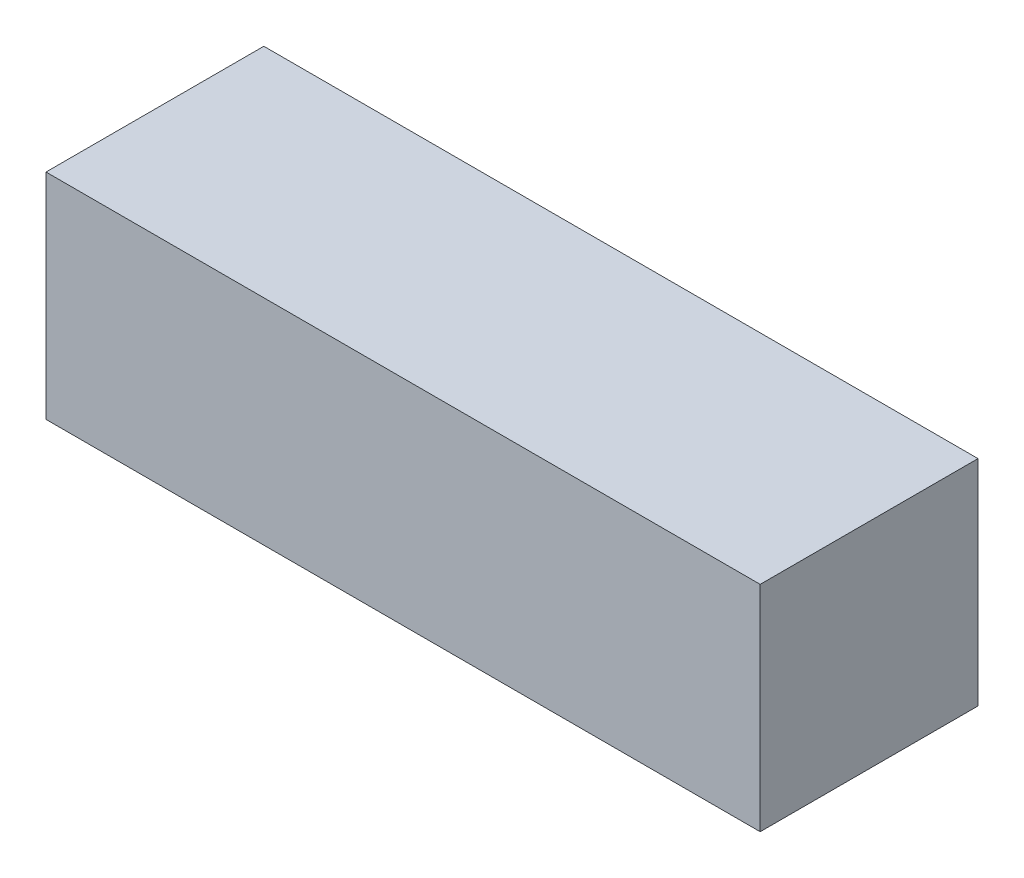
from build123d import *

# Parameters (mm, degrees)
SKETCH1_W      = 200
SKETCH1_H      = 60
EXTRUDE1_DEPTH = 30.5


with BuildPart() as part:
    # Sketch1 → Extrude1 (new, symmetric)
    with BuildSketch(Plane.XY):
        with Locations((100, 30)):
            Rectangle(SKETCH1_W, SKETCH1_H)
    extrude(amount=EXTRUDE1_DEPTH, both=True)


solid = part.part
